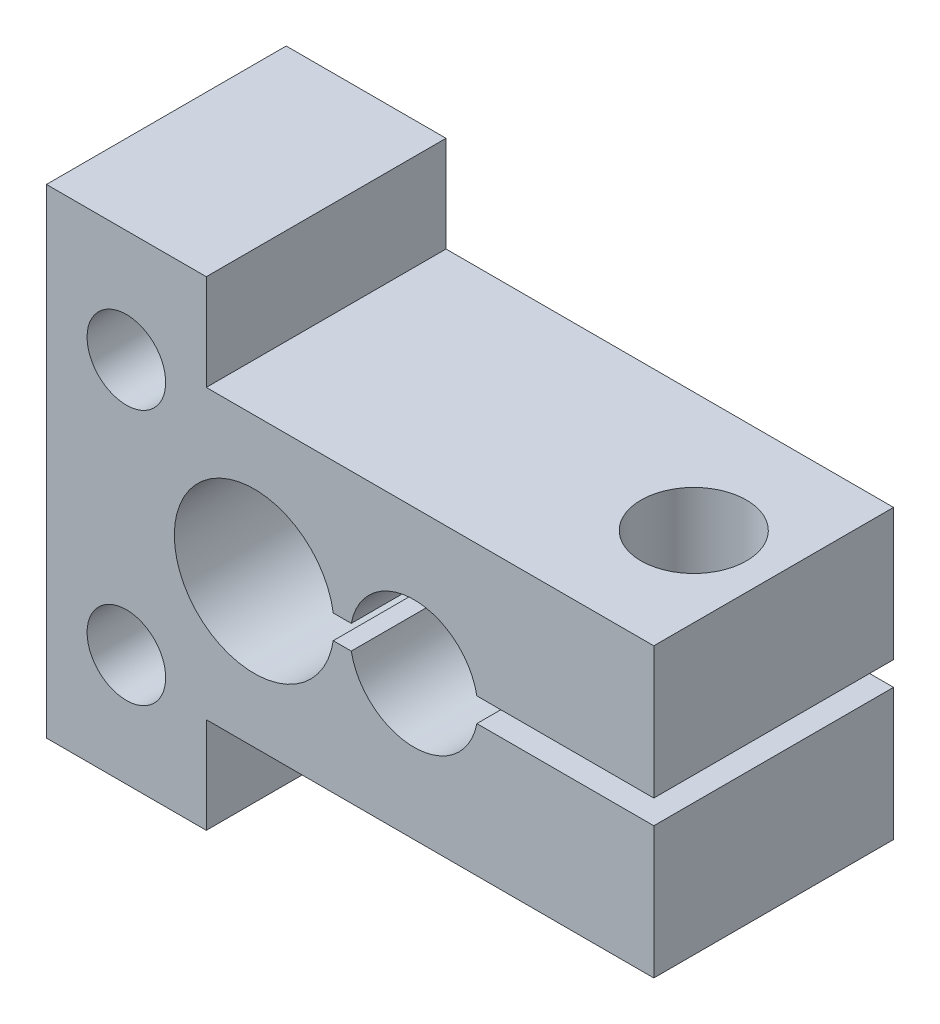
from build123d import *

# Parameters (mm, degrees)
BOSS_EXTRU_1_DEPTH           = 7.5
BOSS_EXTRU_1_DEPTH_BACK      = 7.5
ENL_V_MAT_EXTRU_1_DEPTH      = 8.5
ENL_V_MAT_EXTRU_1_DEPTH_BACK = 8.5
ESQUISSE3_W                  = 2.4585
ESQUISSE3_H                  = 15
ESQUISSE4_W                  = 2.4585
ESQUISSE4_H                  = 15


with BuildPart() as part:
    # Esquisse1 → Boss.-Extru.1 (new, two sides: drawn at the far end of the back side and taken through both)
    with BuildSketch(Plane.XY.offset(-BOSS_EXTRU_1_DEPTH_BACK)):
        Polygon((-13, 15), (-13, -15), (-3, -15), (-3, -9), (25, -9), (25, 9), (-3, 9), (-3, 15), align=None)
    extrude(amount=BOSS_EXTRU_1_DEPTH + BOSS_EXTRU_1_DEPTH_BACK)

    # Esquisse2 → Enl_v. mat.-Extru.1 (cut, two sides: drawn at the far end of the back side and taken through both)
    with BuildSketch(Plane.XY.offset(-ENL_V_MAT_EXTRU_1_DEPTH_BACK)):
        with BuildLine():
            Line((4.943429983, -0.75), (6.070941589, -0.75))
            ThreePointArc((6.070941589, -0.75), (10, -4), (13.929058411, -0.75))
            Line((13.929058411, -0.75), (26, -0.75))
            Line((26, -0.75), (26, 0.75))
            Line((26, 0.75), (13.929058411, 0.75))
            ThreePointArc((13.929058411, 0.75), (10, 4), (6.070941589, 0.75))
            Line((6.070941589, 0.75), (4.943429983, 0.75))
            ThreePointArc((4.943429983, 0.75), (-5, 0), (4.943429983, -0.75))
        make_face()
    extrude(amount=ENL_V_MAT_EXTRU_1_DEPTH + ENL_V_MAT_EXTRU_1_DEPTH_BACK, mode=Mode.SUBTRACT)

    # Esquisse3 → Enl_vement de mati_re-R_volution1 (revolve, cut)
    with BuildSketch(Plane(origin=(0, 8, 0), x_dir=(-1, 0, 0), z_dir=(0, 1, 0)), mode=Mode.PRIVATE) as enl_vement_de_mati_re_r_volution1_sk:
        with Locations((6.77075, 0)):
            Rectangle(ESQUISSE3_W, ESQUISSE3_H)
    revolve(enl_vement_de_mati_re_r_volution1_sk.sketch.rotate(Axis((-8, 8, 7.5), (0, 0, -1)), 180), axis=Axis((-8, 8, 7.5), (0, 0, -1)), mode=Mode.SUBTRACT)

    # Esquisse4 → Enl_vement de mati_re-R_volution2 (revolve, cut)
    with BuildSketch(Plane(origin=(0, -8, 0), x_dir=(-1, 0, 0), z_dir=(0, 1, 0)), mode=Mode.PRIVATE) as enl_vement_de_mati_re_r_volution2_sk:
        with Locations((6.77075, 0)):
            Rectangle(ESQUISSE4_W, ESQUISSE4_H)
    revolve(enl_vement_de_mati_re_r_volution2_sk.sketch.rotate(Axis((-8, -8, 7.5), (0, 0, -1)), 180), axis=Axis((-8, -8, 7.5), (0, 0, -1)), mode=Mode.SUBTRACT)

    # Esquisse5 → Enl_vement de mati_re-R_volution3 (revolve, cut)
    with BuildSketch(Plane.XY, mode=Mode.PRIVATE) as enl_vement_de_mati_re_r_volution3_sk:
        Polygon((20, 9), (23.3, 9), (23.3, 0), (22.4585, 0), (22.4585, -8.4585), (23, -9), (20, -9), align=None)
    revolve(enl_vement_de_mati_re_r_volution3_sk.sketch.rotate(Axis((20, -9, 0), (0, 1, 0)), 270), axis=Axis((20, -9, 0), (0, 1, 0)), mode=Mode.SUBTRACT)


solid = part.part
